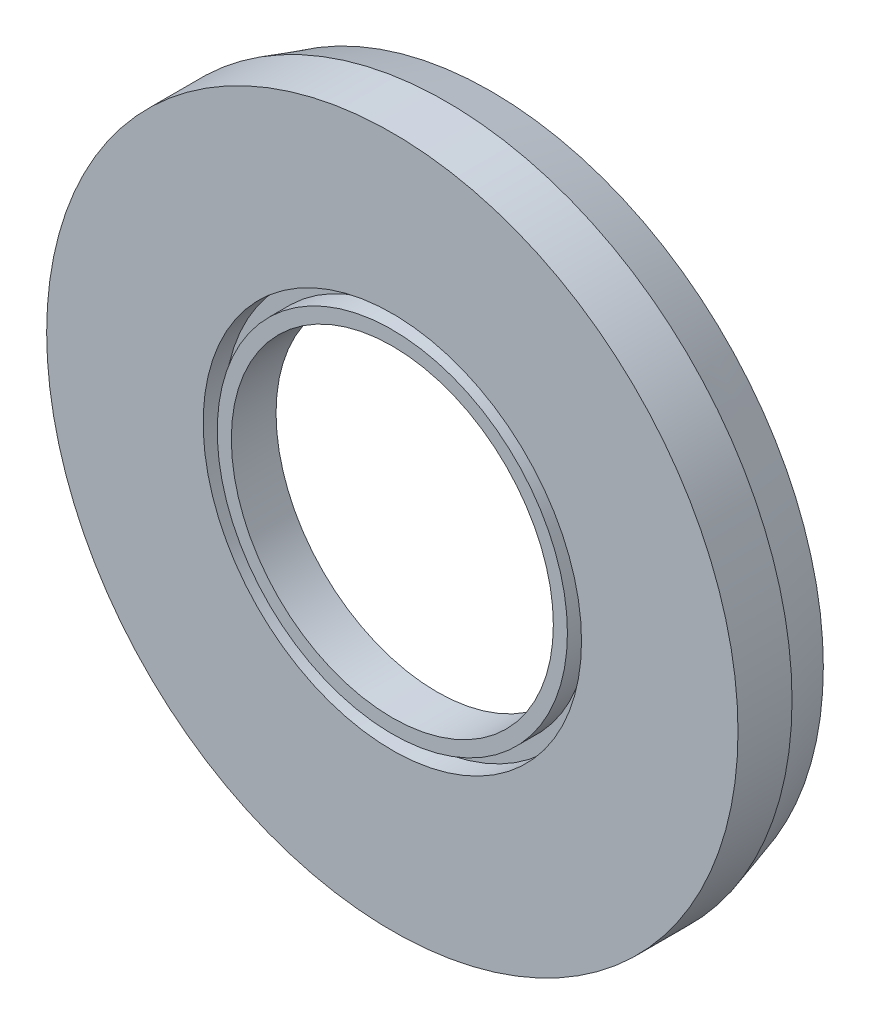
from build123d import *

# Parameters (mm, degrees)
SKETCH1_R           = 24.53894
SKETCH1_R_2         = 11.43
BOSS_EXTRUDE1_DEPTH = 3.175
SKETCH3_R           = 13.43
SKETCH3_R_2         = 12.43
CUT_EXTRUDE1_DEPTH  = 1.5


with BuildPart() as part:
    # Sketch1 → Boss-Extrude1 (new body)
    with BuildSketch(Plane.XY):
        Circle(SKETCH1_R)
        Circle(SKETCH1_R_2, mode=Mode.SUBTRACT)
    extrude(amount=BOSS_EXTRUDE1_DEPTH)

    # Sketch2 → Revolve1 (revolve)
    with BuildSketch(Plane(origin=(0, 0, 0), x_dir=(1, 0, 0), z_dir=(0, 1, 0)), mode=Mode.PRIVATE) as revolve1_sk:
        Polygon((-23.58644, 3.8354), (-24.53894, 0.6604), (-24.53894, 0), (-21.36394, 0), (-21.36394, 0.6604), (-22.31644, 3.8354), (-22.31644, 0.0254), (-23.58644, 0.0254), align=None)
    revolve(revolve1_sk.sketch.rotate(Axis((0, 0, 3.175), (0, 0, -1)), 180), axis=Axis((0, 0, 3.175), (0, 0, -1)))

    # Sketch3 → Cut-Extrude1 (cut)
    with BuildSketch(Plane.XY.offset(3.175)):
        Circle(SKETCH3_R)
        Circle(SKETCH3_R_2, mode=Mode.SUBTRACT)
    extrude(amount=-CUT_EXTRUDE1_DEPTH, mode=Mode.SUBTRACT)


solid = part.part
